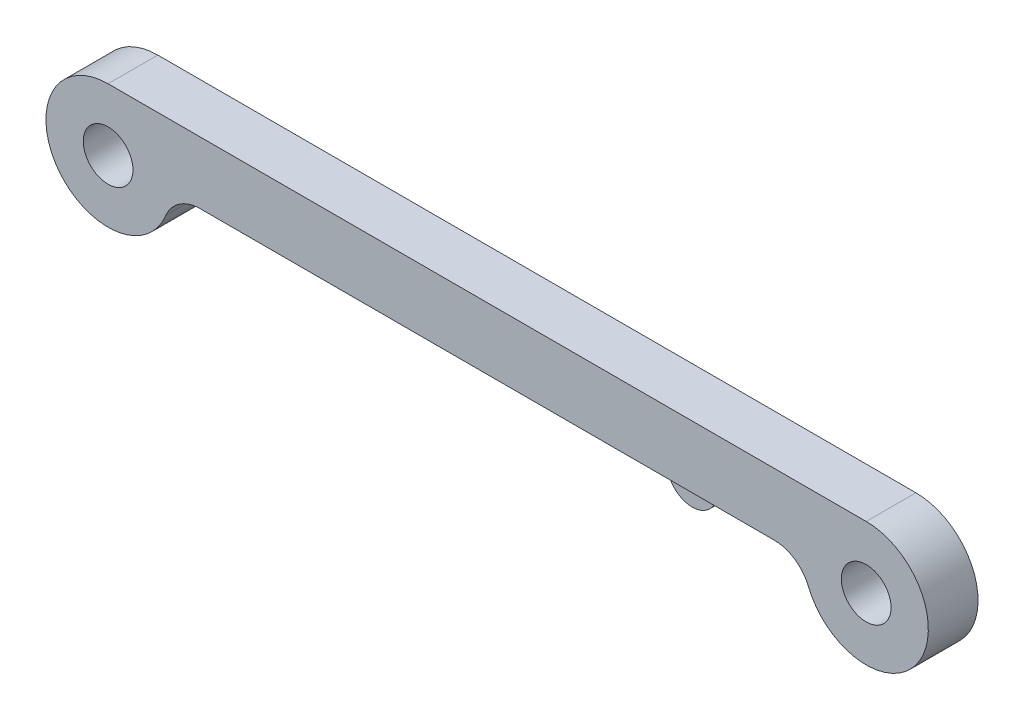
from build123d import *

# Parameters (mm, degrees)
SKETCH1_R           = 2
BOSS_EXTRUDE1_DEPTH = 4
BOSS_EXTRUDE3_START = -1
SKETCH3_R           = 2
SKETCH3_R_2         = 1
BOSS_EXTRUDE3_DEPTH = 2
FILLET1_R           = 1


with BuildPart() as part:
    # Sketch1 → Boss-Extrude1 (new body)
    with BuildSketch(Plane.XY):
        with BuildLine():
            Line((-63.221147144, 4.5), (-2.221147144, 4.5))
            ThreePointArc((-2.221147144, 4.5), (1.924633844, -3.295084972), (-6.856271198, -2.375))
            ThreePointArc((-6.856271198, -2.375), (-7.960294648, -1.012531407), (-9.637345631, -0.5))
            Line((-9.637345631, -0.5), (-55.804948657, -0.5))
            ThreePointArc((-55.804948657, -0.5), (-57.48199964, -1.012531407), (-58.586023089, -2.375))
            ThreePointArc((-58.586023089, -2.375), (-67.366928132, -3.295084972), (-63.221147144, 4.5))
        make_face()
        with Locations((-63.221147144, -0.5)):
            Circle(SKETCH1_R, mode=Mode.SUBTRACT)
        with Locations((-2.221147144, -0.5)):
            Circle(SKETCH1_R, mode=Mode.SUBTRACT)
    extrude(amount=BOSS_EXTRUDE1_DEPTH)

    # Sketch3 → Boss-Extrude3 (add)
    with BuildSketch(Plane.XY.offset(4).offset(BOSS_EXTRUDE3_START)):
        with Locations((-17.221147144, -0.5)):
            Circle(SKETCH3_R)
        with Locations((-17.221147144, -0.5)):
            Circle(SKETCH3_R_2, mode=Mode.SUBTRACT)
    extrude(amount=-BOSS_EXTRUDE3_DEPTH)

    # Fillet1
    fillet1_edges = [part.edges().sort_by_distance(p)[0] for p in [
        (-15.221147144, -0.5, 2),
        (-19.221147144, -0.5, 2),
    ]]
    fillet(fillet1_edges, radius=FILLET1_R)


solid = part.part
